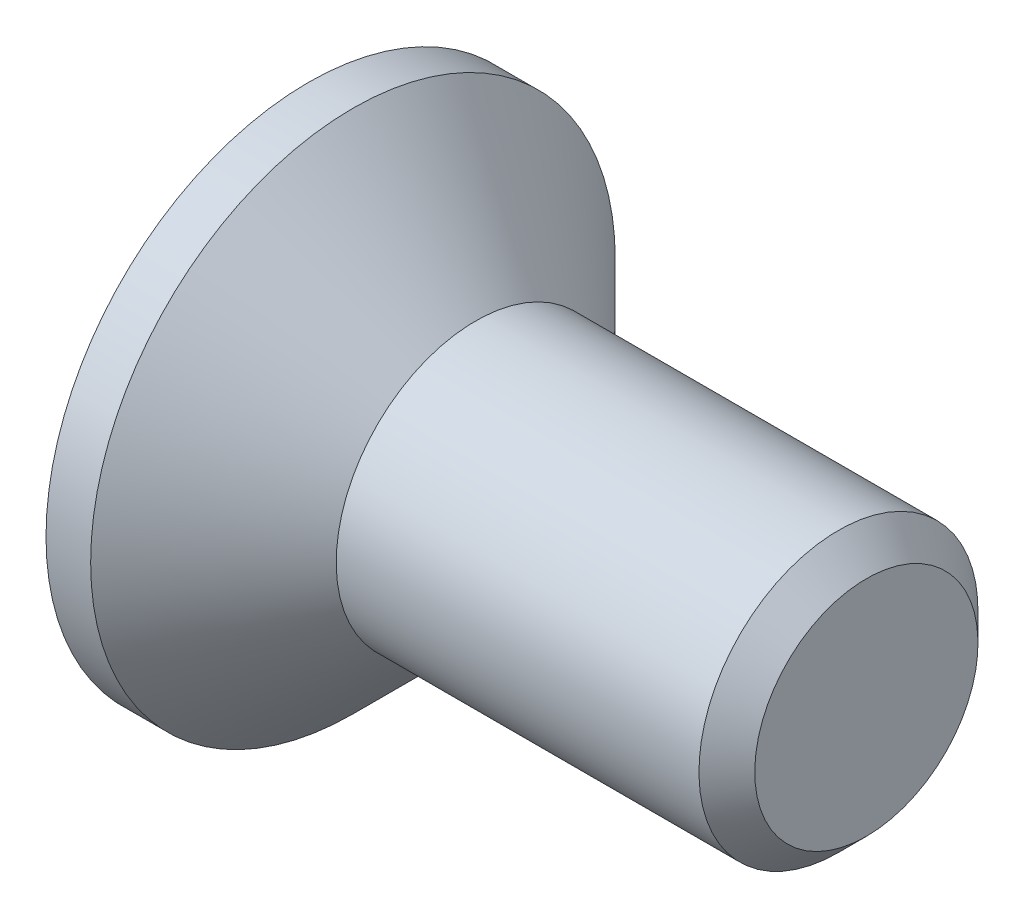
from build123d import *

# Parameters (mm, degrees)
CHAMFER1_SIZE      = 0.25
CUT_EXTRUDE1_DEPTH = 1.25


with BuildPart() as part:
    # Sketch1 → Revolve1 (revolve)
    with BuildSketch(Plane.XY, mode=Mode.PRIVATE) as revolve1_sk:
        Polygon((-1.5, 2.35), (-1.5, 0), (3.5, 0), (3.5, 1.25), (0, 1.25), (-1.1, 2.35), align=None)
    revolve(revolve1_sk.sketch.rotate(Axis((-1.5, 0, 0), (1, 0, 0)), 180), axis=Axis((-1.5, 0, 0), (1, 0, 0)))

    # Chamfer1
    chamfer1_edges = [part.edges().sort_by_distance(p)[0] for p in [
        (3.5, 1.25, 0),
    ]]
    chamfer(chamfer1_edges, length=CHAMFER1_SIZE)

    # Sketch2 → Cut-Extrude1 (cut)
    with BuildSketch(Plane.ZY.offset(1.5)):
        Polygon((-0.34, 1.35), (0.34, 1.35), (0.34, 0.34), (1.35, 0.34), (1.35, -0.34), (0.34, -0.34), (0.34, -1.35), (-0.34, -1.35), (-0.34, -0.34), (-1.35, -0.34), (-1.35, 0.34), (-0.34, 0.34), align=None)
    extrude(amount=-CUT_EXTRUDE1_DEPTH, mode=Mode.SUBTRACT)


solid = part.part
